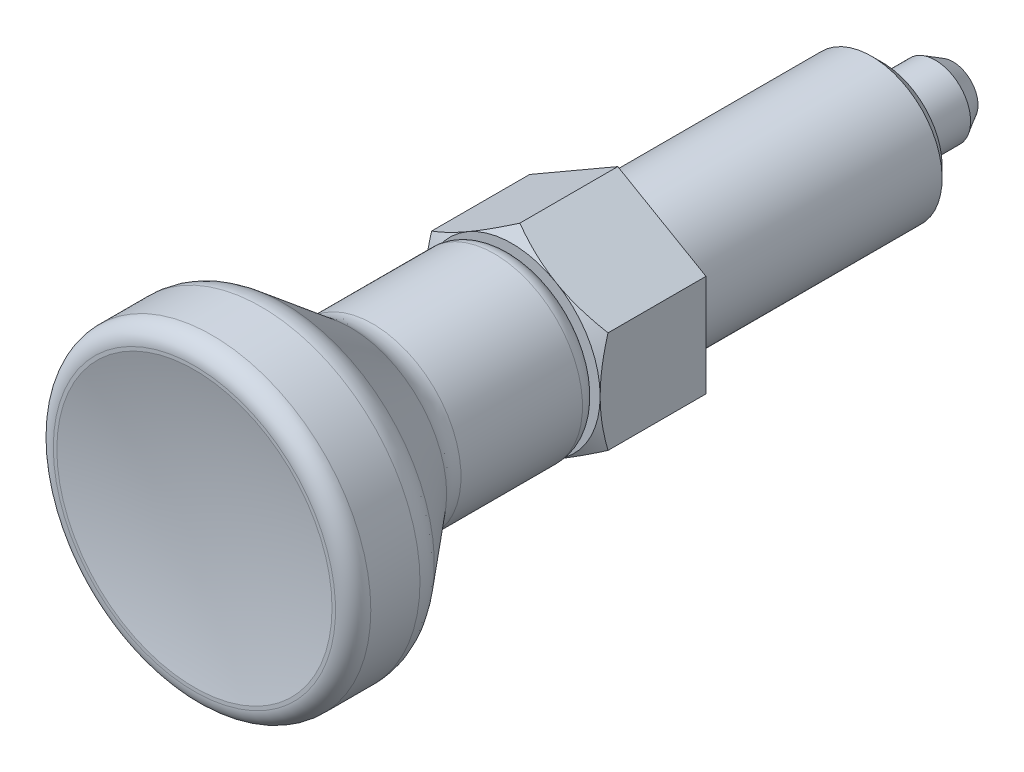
ISO-10303-21;
HEADER;
FILE_DESCRIPTION(('STEP AP214'),'2;1');
FILE_NAME('part.step','',(''),(''),'','','');
FILE_SCHEMA(('AUTOMOTIVE_DESIGN { 1 0 10303 214 1 1 1 1 }'));
ENDSEC;
DATA;
#1=APPLICATION_CONTEXT('core data for automotive mechanical design processes');
#2=APPLICATION_PROTOCOL_DEFINITION('international standard','automotive_design',2000,#1);
#3=PRODUCT_CONTEXT('',#1,'mechanical');
#4=PRODUCT('Part','Part','',(#3));
#5=PRODUCT_RELATED_PRODUCT_CATEGORY('part','',(#4));
#6=PRODUCT_DEFINITION_FORMATION('','',#4);
#7=PRODUCT_DEFINITION_CONTEXT('part definition',#1,'design');
#8=PRODUCT_DEFINITION('design','',#6,#7);
#9=PRODUCT_DEFINITION_SHAPE('','',#8);
#10=(LENGTH_UNIT() NAMED_UNIT(*) SI_UNIT(.MILLI.,.METRE.));
#11=(NAMED_UNIT(*) PLANE_ANGLE_UNIT() SI_UNIT($,.RADIAN.));
#12=(NAMED_UNIT(*) SI_UNIT($,.STERADIAN.) SOLID_ANGLE_UNIT());
#13=UNCERTAINTY_MEASURE_WITH_UNIT(LENGTH_MEASURE(1.E-05),#10,'distance_accuracy_value','');
#14=(GEOMETRIC_REPRESENTATION_CONTEXT(3) GLOBAL_UNCERTAINTY_ASSIGNED_CONTEXT((#13)) GLOBAL_UNIT_ASSIGNED_CONTEXT((#10,
#11,#12)) REPRESENTATION_CONTEXT('',''));
#15=CARTESIAN_POINT('',(0.,0.,0.));
#16=DIRECTION('',(0.,0.,1.));
#17=DIRECTION('',(1.,0.,0.));
#18=AXIS2_PLACEMENT_3D('',#15,#16,#17);
#19=CARTESIAN_POINT('',(0.,0.,3.1132486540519));
#20=DIRECTION('',(0.,0.,-1.));
#21=DIRECTION('',(0.,1.,0.));
#22=AXIS2_PLACEMENT_3D('',#19,#20,#21);
#23=CONICAL_SURFACE('',#22,10.,1.0471975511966);
#24=CARTESIAN_POINT('',(-5.,7.79521366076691,3.53993434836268));
#25=CARTESIAN_POINT('',(-5.,7.57645280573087,3.64621736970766));
#26=CARTESIAN_POINT('',(-5.,7.35719409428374,3.75149299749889));
#27=CARTESIAN_POINT('',(-5.,6.9174162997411,3.95946359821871));
#28=CARTESIAN_POINT('',(-5.,6.69689702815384,4.06215817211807));
#29=CARTESIAN_POINT('',(-5.,6.25321722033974,4.26490852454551));
#30=CARTESIAN_POINT('',(-5.,6.03004886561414,4.36494725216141));
#31=CARTESIAN_POINT('',(-5.,5.58195110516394,4.56098433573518));
#32=CARTESIAN_POINT('',(-5.,5.35702178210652,4.65698288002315));
#33=CARTESIAN_POINT('',(-5.,4.89769068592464,4.84691481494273));
#34=CARTESIAN_POINT('',(-5.,4.66321876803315,4.9406794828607));
#35=CARTESIAN_POINT('',(-5.,4.19154711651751,5.12121121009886));
#36=CARTESIAN_POINT('',(-5.,3.95434708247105,5.2079774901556));
#37=CARTESIAN_POINT('',(-5.,3.4772724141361,5.37226520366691));
#38=CARTESIAN_POINT('',(-5.,3.23740416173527,5.44980498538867));
#39=CARTESIAN_POINT('',(-5.,2.75422725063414,5.59317898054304));
#40=CARTESIAN_POINT('',(-5.,2.51091968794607,5.65901683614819));
#41=CARTESIAN_POINT('',(-5.,2.02205222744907,5.775510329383));
#42=CARTESIAN_POINT('',(-5.,1.77651220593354,5.82624785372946));
#43=CARTESIAN_POINT('',(-5.,1.28233650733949,5.90969033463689));
#44=CARTESIAN_POINT('',(-5.,1.03370114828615,5.94239712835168));
#45=CARTESIAN_POINT('',(-5.,0.537842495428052,5.98674256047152));
#46=CARTESIAN_POINT('',(-5.,0.290644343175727,5.99865539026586));
#47=CARTESIAN_POINT('',(-5.,-0.203882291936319,6.00112730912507));
#48=CARTESIAN_POINT('',(-5.,-0.451210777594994,5.99168591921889));
#49=CARTESIAN_POINT('',(-5.,-0.869833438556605,5.95830505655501));
#50=CARTESIAN_POINT('',(-5.,-1.04157084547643,5.93959455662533));
#51=CARTESIAN_POINT('',(-5.,-1.38380826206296,5.89301976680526));
#52=CARTESIAN_POINT('',(-5.,-1.55430810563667,5.86515427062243));
#53=CARTESIAN_POINT('',(-5.,-2.06370854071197,5.76928789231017));
#54=CARTESIAN_POINT('',(-5.,-2.40032984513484,5.68903341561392));
#55=CARTESIAN_POINT('',(-5.,-2.90383846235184,5.54959195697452));
#56=CARTESIAN_POINT('',(-5.,-3.07332661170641,5.49925959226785));
#57=CARTESIAN_POINT('',(-5.,-3.41065642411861,5.39330236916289));
#58=CARTESIAN_POINT('',(-5.,-3.57849807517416,5.33767747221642));
#59=CARTESIAN_POINT('',(-5.,-3.91258846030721,5.22203339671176));
#60=CARTESIAN_POINT('',(-5.,-4.07883767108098,5.16201558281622));
#61=CARTESIAN_POINT('',(-5.,-4.40995264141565,5.03829841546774));
#62=CARTESIAN_POINT('',(-5.,-4.57481842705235,4.97459913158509));
#63=CARTESIAN_POINT('',(-5.,-5.00125658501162,4.80523740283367));
#64=CARTESIAN_POINT('',(-5.,-5.26188398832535,4.69719842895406));
#65=CARTESIAN_POINT('',(-5.,-5.7806153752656,4.47520370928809));
#66=CARTESIAN_POINT('',(-5.,-6.0387191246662,4.3612474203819));
#67=CARTESIAN_POINT('',(-5.,-6.55294218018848,4.12875854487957));
#68=CARTESIAN_POINT('',(-5.,-6.80906088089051,4.01022462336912));
#69=CARTESIAN_POINT('',(-5.,-7.31963206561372,3.7696140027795));
#70=CARTESIAN_POINT('',(-5.,-7.57408450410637,3.64753720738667));
#71=CARTESIAN_POINT('',(-5.,-8.08197779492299,3.40041520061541));
#72=CARTESIAN_POINT('',(-5.,-8.33541675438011,3.27536610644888));
#73=CARTESIAN_POINT('',(-5.,-8.84117201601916,3.02301564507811));
#74=CARTESIAN_POINT('',(-5.,-9.09348830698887,2.89571425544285));
#75=CARTESIAN_POINT('',(-5.,-9.84895753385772,2.51114226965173));
#76=CARTESIAN_POINT('',(-5.,-10.3507276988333,2.25115628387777));
#77=CARTESIAN_POINT('',(-5.,-11.3022827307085,1.75218100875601));
#78=CARTESIAN_POINT('',(-5.,-11.7523102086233,1.51365220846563));
#79=CARTESIAN_POINT('',(-5.,-12.6508152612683,1.03363917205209));
#80=CARTESIAN_POINT('',(-5.,-13.0992927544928,0.792154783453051));
#81=CARTESIAN_POINT('',(-5.,-13.993693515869,0.307716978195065));
#82=CARTESIAN_POINT('',(-5.,-14.4396204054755,0.0647702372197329));
#83=CARTESIAN_POINT('',(-5.,-15.3305024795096,-0.422825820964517));
#84=CARTESIAN_POINT('',(-5.,-15.7754577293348,-0.667475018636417));
#85=CARTESIAN_POINT('',(-5.,-16.2200666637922,-0.91274800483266));
#86=B_SPLINE_CURVE_WITH_KNOTS('',3,(#24,#25,#26,#27,#28,#29,#30,#31,#32,#33,#34,#35,#36,#37,#38,
#39,#40,#41,#42,#43,#44,#45,#46,#47,#48,#49,#50,#51,#52,#53,#54,#55,#56,#57,#58,#59,#60,#61,#62,
#63,#64,#65,#66,#67,#68,#69,#70,#71,#72,#73,#74,#75,#76,#77,#78,#79,#80,#81,#82,#83,#84,#85),
.UNSPECIFIED.,.F.,.F.,(4,2,2,2,2,2,2,2,2,2,2,2,2,2,2,2,2,2,2,2,2,2,2,2,2,2,2,2,2,2,4),(0.,
0.729646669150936,1.45940545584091,2.19306727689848,2.9266948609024,3.68418360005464,
4.44175656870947,5.19779687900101,5.95360146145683,6.70522945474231,7.45678085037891,
8.19834515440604,8.93992609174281,9.45793663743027,9.97601546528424,11.0127134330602,
11.5430787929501,12.0734480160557,12.6036531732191,13.1338483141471,13.9801413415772,
14.8265121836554,15.6731317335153,16.5197743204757,17.3675913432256,18.2154168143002,
19.9107440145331,21.4387334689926,22.9668020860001,24.4902367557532,26.0135655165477),.UNSPECIFIED.);
#87=CARTESIAN_POINT('',(-5.,-2.8867513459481,5.55341801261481));
#88=VERTEX_POINT('',#87);
#89=CARTESIAN_POINT('',(-5.,0.,6.));
#90=VERTEX_POINT('',#89);
#91=EDGE_CURVE('E9',#88,#90,#86,.F.);
#92=ORIENTED_EDGE('',*,*,#91,.F.);
#93=CARTESIAN_POINT('',(0.0002,-5.77361816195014,5.55335134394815));
#94=CARTESIAN_POINT('',(-0.219534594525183,-5.64675433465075,5.62661343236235));
#95=CARTESIAN_POINT('',(-0.441148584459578,-5.51880543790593,5.69324867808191));
#96=CARTESIAN_POINT('',(-0.88821399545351,-5.26069210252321,5.80956100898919));
#97=CARTESIAN_POINT('',(-1.11367335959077,-5.13052307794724,5.85919695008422));
#98=CARTESIAN_POINT('',(-1.56183230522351,-4.87177839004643,5.93644897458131));
#99=CARTESIAN_POINT('',(-1.78446209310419,-4.74324302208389,5.96457962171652));
#100=CARTESIAN_POINT('',(-2.11918990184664,-4.54998783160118,5.98980507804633));
#101=CARTESIAN_POINT('',(-2.23084219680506,-4.48552534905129,5.99538654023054));
#102=CARTESIAN_POINT('',(-2.4542499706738,-4.35654081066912,6.00079778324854));
#103=CARTESIAN_POINT('',(-2.56600544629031,-4.29201875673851,6.0006277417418));
#104=CARTESIAN_POINT('',(-2.87218423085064,-4.11524635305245,5.99224636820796));
#105=CARTESIAN_POINT('',(-3.06650608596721,-4.00305457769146,5.97817022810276));
#106=CARTESIAN_POINT('',(-3.45386010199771,-3.77941563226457,5.9335347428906));
#107=CARTESIAN_POINT('',(-3.64689090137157,-3.66796924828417,5.90296013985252));
#108=CARTESIAN_POINT('',(-4.03502534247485,-3.44387972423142,5.82653150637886));
#109=CARTESIAN_POINT('',(-4.23007999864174,-3.33126486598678,5.78035362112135));
#110=CARTESIAN_POINT('',(-4.61728034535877,-3.10771464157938,5.67554820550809));
#111=CARTESIAN_POINT('',(-4.80943099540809,-2.99677641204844,5.61694529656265));
#112=CARTESIAN_POINT('',(-5.0002,-2.88663587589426,5.55335134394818));
#113=B_SPLINE_CURVE_WITH_KNOTS('',3,(#93,#94,#95,#96,#97,#98,#99,#100,#101,#102,#103,#104,#105,
#106,#107,#108,#109,#110,#111,#112),.UNSPECIFIED.,.F.,.F.,(4,2,2,2,2,2,2,2,2,4),(0.,
0.792555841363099,1.58701660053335,2.36181537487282,2.74884076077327,3.13585419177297,
3.80962362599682,4.48401723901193,5.17336882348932,5.8613669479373),.UNSPECIFIED.);
#114=CARTESIAN_POINT('',(-2.50000000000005,-4.33012701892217,6.));
#115=VERTEX_POINT('',#114);
#116=EDGE_CURVE('E207',#115,#88,#113,.T.);
#117=ORIENTED_EDGE('',*,*,#116,.F.);
#118=CARTESIAN_POINT('',(0.,0.,6.));
#119=DIRECTION('',(0.,0.,1.));
#120=DIRECTION('',(0.,-1.,0.));
#121=AXIS2_PLACEMENT_3D('',#118,#119,#120);
#122=CIRCLE('',#121,5.);
#123=EDGE_CURVE('E265',#90,#115,#122,.T.);
#124=ORIENTED_EDGE('',*,*,#123,.F.);
#125=EDGE_LOOP('',(#92,#117,#124));
#126=FACE_BOUND('',#125,.T.);
#127=ADVANCED_FACE('F14',(#126),#23,.T.);
#128=CARTESIAN_POINT('',(-5.,2.8867513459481,5.55341801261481));
#129=VERTEX_POINT('',#128);
#130=EDGE_CURVE('E18',#90,#129,#86,.F.);
#131=ORIENTED_EDGE('',*,*,#130,.F.);
#132=CARTESIAN_POINT('',(-2.50000000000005,4.33012701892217,6.));
#133=VERTEX_POINT('',#132);
#134=EDGE_CURVE('E116',#133,#90,#122,.T.);
#135=ORIENTED_EDGE('',*,*,#134,.F.);
#136=CARTESIAN_POINT('',(-5.0002,2.88663587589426,5.55335134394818));
#137=CARTESIAN_POINT('',(-4.78046540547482,3.01349970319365,5.62661343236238));
#138=CARTESIAN_POINT('',(-4.55885141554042,3.14144859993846,5.69324867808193));
#139=CARTESIAN_POINT('',(-4.1117860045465,3.39956193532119,5.80956100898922));
#140=CARTESIAN_POINT('',(-3.88632664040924,3.52973095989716,5.85919695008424));
#141=CARTESIAN_POINT('',(-3.43816769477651,3.78847564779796,5.93644897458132));
#142=CARTESIAN_POINT('',(-3.21553790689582,3.9170110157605,5.96457962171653));
#143=CARTESIAN_POINT('',(-2.88081009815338,4.11026620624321,5.98980507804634));
#144=CARTESIAN_POINT('',(-2.76915780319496,4.1747286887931,5.99538654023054));
#145=CARTESIAN_POINT('',(-2.54575002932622,4.30371322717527,6.00079778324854));
#146=CARTESIAN_POINT('',(-2.43399455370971,4.36823528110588,6.00062774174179));
#147=CARTESIAN_POINT('',(-2.12781576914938,4.54500768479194,5.99224636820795));
#148=CARTESIAN_POINT('',(-1.9334939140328,4.65719946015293,5.97817022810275));
#149=CARTESIAN_POINT('',(-1.5461398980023,4.88083840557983,5.93353474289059));
#150=CARTESIAN_POINT('',(-1.35310909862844,4.99228478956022,5.9029601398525));
#151=CARTESIAN_POINT('',(-0.96497465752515,5.21637431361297,5.82653150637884));
#152=CARTESIAN_POINT('',(-0.769920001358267,5.32898917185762,5.78035362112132));
#153=CARTESIAN_POINT('',(-0.382719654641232,5.55253939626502,5.67554820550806));
#154=CARTESIAN_POINT('',(-0.190569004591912,5.66347762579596,5.61694529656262));
#155=CARTESIAN_POINT('',(0.000200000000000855,5.77361816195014,5.55335134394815));
#156=B_SPLINE_CURVE_WITH_KNOTS('',3,(#136,#137,#138,#139,#140,#141,#142,#143,#144,#145,#146,
#147,#148,#149,#150,#151,#152,#153,#154,#155),.UNSPECIFIED.,.F.,.F.,(4,2,2,2,2,2,2,2,2,4),(0.,
0.792555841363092,1.58701660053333,2.3618153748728,2.74884076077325,3.13585419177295,
3.8096236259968,4.48401723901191,5.17336882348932,5.8613669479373),.UNSPECIFIED.);
#157=EDGE_CURVE('E268',#129,#133,#156,.T.);
#158=ORIENTED_EDGE('',*,*,#157,.F.);
#159=EDGE_LOOP('',(#131,#135,#158));
#160=FACE_BOUND('',#159,.T.);
#161=ADVANCED_FACE('F229',(#160),#23,.T.);
#162=CARTESIAN_POINT('',(0.,5.7735026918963,5.55341801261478));
#163=VERTEX_POINT('',#162);
#164=EDGE_CURVE('E112',#133,#163,#156,.T.);
#165=ORIENTED_EDGE('',*,*,#164,.F.);
#166=CARTESIAN_POINT('',(2.50000000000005,4.33012701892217,6.));
#167=VERTEX_POINT('',#166);
#168=EDGE_CURVE('E110',#167,#133,#122,.T.);
#169=ORIENTED_EDGE('',*,*,#168,.F.);
#170=CARTESIAN_POINT('',(-0.0002,5.77361816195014,5.55335134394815));
#171=CARTESIAN_POINT('',(0.219534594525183,5.64675433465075,5.62661343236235));
#172=CARTESIAN_POINT('',(0.441148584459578,5.51880543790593,5.69324867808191));
#173=CARTESIAN_POINT('',(0.88821399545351,5.26069210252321,5.80956100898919));
#174=CARTESIAN_POINT('',(1.11367335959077,5.13052307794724,5.85919695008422));
#175=CARTESIAN_POINT('',(1.56183230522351,4.87177839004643,5.93644897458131));
#176=CARTESIAN_POINT('',(1.78446209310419,4.74324302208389,5.96457962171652));
#177=CARTESIAN_POINT('',(2.11918990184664,4.54998783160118,5.98980507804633));
#178=CARTESIAN_POINT('',(2.23084219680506,4.48552534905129,5.99538654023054));
#179=CARTESIAN_POINT('',(2.4542499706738,4.35654081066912,6.00079778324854));
#180=CARTESIAN_POINT('',(2.56600544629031,4.29201875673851,6.0006277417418));
#181=CARTESIAN_POINT('',(2.87218423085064,4.11524635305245,5.99224636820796));
#182=CARTESIAN_POINT('',(3.06650608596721,4.00305457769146,5.97817022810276));
#183=CARTESIAN_POINT('',(3.45386010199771,3.77941563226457,5.9335347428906));
#184=CARTESIAN_POINT('',(3.64689090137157,3.66796924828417,5.90296013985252));
#185=CARTESIAN_POINT('',(4.03502534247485,3.44387972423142,5.82653150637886));
#186=CARTESIAN_POINT('',(4.23007999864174,3.33126486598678,5.78035362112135));
#187=CARTESIAN_POINT('',(4.61728034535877,3.10771464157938,5.67554820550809));
#188=CARTESIAN_POINT('',(4.80943099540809,2.99677641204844,5.61694529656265));
#189=CARTESIAN_POINT('',(5.0002,2.88663587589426,5.55335134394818));
#190=B_SPLINE_CURVE_WITH_KNOTS('',3,(#170,#171,#172,#173,#174,#175,#176,#177,#178,#179,#180,
#181,#182,#183,#184,#185,#186,#187,#188,#189),.UNSPECIFIED.,.F.,.F.,(4,2,2,2,2,2,2,2,2,4),(0.,
0.792555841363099,1.58701660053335,2.36181537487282,2.74884076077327,3.13585419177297,
3.80962362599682,4.48401723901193,5.17336882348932,5.8613669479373),.UNSPECIFIED.);
#191=EDGE_CURVE('E90',#163,#167,#190,.T.);
#192=ORIENTED_EDGE('',*,*,#191,.F.);
#193=EDGE_LOOP('',(#165,#169,#192));
#194=FACE_BOUND('',#193,.T.);
#195=ADVANCED_FACE('F111',(#194),#23,.T.);
#196=CARTESIAN_POINT('',(0.,-5.7735026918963,5.55341801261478));
#197=VERTEX_POINT('',#196);
#198=EDGE_CURVE('E202',#197,#115,#113,.T.);
#199=ORIENTED_EDGE('',*,*,#198,.F.);
#200=CARTESIAN_POINT('',(5.0002,-2.88663587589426,5.55335134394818));
#201=CARTESIAN_POINT('',(4.78046540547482,-3.01349970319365,5.62661343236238));
#202=CARTESIAN_POINT('',(4.55885141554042,-3.14144859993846,5.69324867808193));
#203=CARTESIAN_POINT('',(4.1117860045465,-3.39956193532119,5.80956100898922));
#204=CARTESIAN_POINT('',(3.88632664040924,-3.52973095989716,5.85919695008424));
#205=CARTESIAN_POINT('',(3.43816769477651,-3.78847564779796,5.93644897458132));
#206=CARTESIAN_POINT('',(3.21553790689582,-3.9170110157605,5.96457962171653));
#207=CARTESIAN_POINT('',(2.88081009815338,-4.11026620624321,5.98980507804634));
#208=CARTESIAN_POINT('',(2.76915780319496,-4.1747286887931,5.99538654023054));
#209=CARTESIAN_POINT('',(2.54575002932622,-4.30371322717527,6.00079778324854));
#210=CARTESIAN_POINT('',(2.43399455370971,-4.36823528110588,6.00062774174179));
#211=CARTESIAN_POINT('',(2.12781576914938,-4.54500768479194,5.99224636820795));
#212=CARTESIAN_POINT('',(1.9334939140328,-4.65719946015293,5.97817022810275));
#213=CARTESIAN_POINT('',(1.5461398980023,-4.88083840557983,5.93353474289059));
#214=CARTESIAN_POINT('',(1.35310909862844,-4.99228478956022,5.9029601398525));
#215=CARTESIAN_POINT('',(0.96497465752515,-5.21637431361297,5.82653150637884));
#216=CARTESIAN_POINT('',(0.769920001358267,-5.32898917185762,5.78035362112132));
#217=CARTESIAN_POINT('',(0.382719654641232,-5.55253939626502,5.67554820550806));
#218=CARTESIAN_POINT('',(0.190569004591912,-5.66347762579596,5.61694529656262));
#219=CARTESIAN_POINT('',(-0.000200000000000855,-5.77361816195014,5.55335134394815));
#220=B_SPLINE_CURVE_WITH_KNOTS('',3,(#200,#201,#202,#203,#204,#205,#206,#207,#208,#209,#210,
#211,#212,#213,#214,#215,#216,#217,#218,#219),.UNSPECIFIED.,.F.,.F.,(4,2,2,2,2,2,2,2,2,4),(0.,
0.792555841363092,1.58701660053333,2.3618153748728,2.74884076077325,3.13585419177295,
3.8096236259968,4.48401723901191,5.17336882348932,5.8613669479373),.UNSPECIFIED.);
#221=CARTESIAN_POINT('',(2.50000000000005,-4.33012701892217,6.));
#222=VERTEX_POINT('',#221);
#223=EDGE_CURVE('E100',#222,#197,#220,.T.);
#224=ORIENTED_EDGE('',*,*,#223,.F.);
#225=EDGE_CURVE('E123',#115,#222,#122,.T.);
#226=ORIENTED_EDGE('',*,*,#225,.F.);
#227=EDGE_LOOP('',(#199,#224,#226));
#228=FACE_BOUND('',#227,.T.);
#229=ADVANCED_FACE('F247',(#228),#23,.T.);
#230=CARTESIAN_POINT('',(5.,2.8867513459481,5.55341801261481));
#231=VERTEX_POINT('',#230);
#232=EDGE_CURVE('E94',#167,#231,#190,.T.);
#233=ORIENTED_EDGE('',*,*,#232,.F.);
#234=CARTESIAN_POINT('',(5.,0.,6.));
#235=VERTEX_POINT('',#234);
#236=EDGE_CURVE('E106',#235,#167,#122,.T.);
#237=ORIENTED_EDGE('',*,*,#236,.F.);
#238=CARTESIAN_POINT('',(5.,7.79521366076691,3.53993434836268));
#239=CARTESIAN_POINT('',(5.,7.57645280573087,3.64621736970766));
#240=CARTESIAN_POINT('',(5.,7.35719409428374,3.75149299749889));
#241=CARTESIAN_POINT('',(5.,6.9174162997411,3.95946359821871));
#242=CARTESIAN_POINT('',(5.,6.69689702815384,4.06215817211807));
#243=CARTESIAN_POINT('',(5.,6.25321722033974,4.26490852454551));
#244=CARTESIAN_POINT('',(5.,6.03004886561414,4.36494725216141));
#245=CARTESIAN_POINT('',(5.,5.58195110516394,4.56098433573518));
#246=CARTESIAN_POINT('',(5.,5.35702178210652,4.65698288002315));
#247=CARTESIAN_POINT('',(5.,4.89769068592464,4.84691481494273));
#248=CARTESIAN_POINT('',(5.,4.66321876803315,4.9406794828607));
#249=CARTESIAN_POINT('',(5.,4.19154711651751,5.12121121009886));
#250=CARTESIAN_POINT('',(5.,3.95434708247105,5.2079774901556));
#251=CARTESIAN_POINT('',(5.,3.4772724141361,5.37226520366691));
#252=CARTESIAN_POINT('',(5.,3.23740416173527,5.44980498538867));
#253=CARTESIAN_POINT('',(5.,2.75422725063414,5.59317898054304));
#254=CARTESIAN_POINT('',(5.,2.51091968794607,5.65901683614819));
#255=CARTESIAN_POINT('',(5.,2.02205222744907,5.775510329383));
#256=CARTESIAN_POINT('',(5.,1.77651220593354,5.82624785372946));
#257=CARTESIAN_POINT('',(5.,1.28233650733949,5.90969033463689));
#258=CARTESIAN_POINT('',(5.,1.03370114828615,5.94239712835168));
#259=CARTESIAN_POINT('',(5.,0.537842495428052,5.98674256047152));
#260=CARTESIAN_POINT('',(5.,0.290644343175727,5.99865539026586));
#261=CARTESIAN_POINT('',(5.,-0.203882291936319,6.00112730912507));
#262=CARTESIAN_POINT('',(5.,-0.451210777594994,5.99168591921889));
#263=CARTESIAN_POINT('',(5.,-0.869833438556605,5.95830505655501));
#264=CARTESIAN_POINT('',(5.,-1.04157084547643,5.93959455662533));
#265=CARTESIAN_POINT('',(5.,-1.38380826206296,5.89301976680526));
#266=CARTESIAN_POINT('',(5.,-1.55430810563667,5.86515427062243));
#267=CARTESIAN_POINT('',(5.,-2.06370854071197,5.76928789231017));
#268=CARTESIAN_POINT('',(5.,-2.40032984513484,5.68903341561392));
#269=CARTESIAN_POINT('',(5.,-2.90383846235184,5.54959195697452));
#270=CARTESIAN_POINT('',(5.,-3.07332661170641,5.49925959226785));
#271=CARTESIAN_POINT('',(5.,-3.41065642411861,5.39330236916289));
#272=CARTESIAN_POINT('',(5.,-3.57849807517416,5.33767747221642));
#273=CARTESIAN_POINT('',(5.,-3.91258846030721,5.22203339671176));
#274=CARTESIAN_POINT('',(5.,-4.07883767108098,5.16201558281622));
#275=CARTESIAN_POINT('',(5.,-4.40995264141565,5.03829841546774));
#276=CARTESIAN_POINT('',(5.,-4.57481842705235,4.97459913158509));
#277=CARTESIAN_POINT('',(5.,-5.00125658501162,4.80523740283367));
#278=CARTESIAN_POINT('',(5.,-5.26188398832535,4.69719842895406));
#279=CARTESIAN_POINT('',(5.,-5.7806153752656,4.47520370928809));
#280=CARTESIAN_POINT('',(5.,-6.0387191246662,4.3612474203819));
#281=CARTESIAN_POINT('',(5.,-6.55294218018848,4.12875854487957));
#282=CARTESIAN_POINT('',(5.,-6.80906088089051,4.01022462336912));
#283=CARTESIAN_POINT('',(5.,-7.31963206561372,3.7696140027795));
#284=CARTESIAN_POINT('',(5.,-7.57408450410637,3.64753720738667));
#285=CARTESIAN_POINT('',(5.,-8.08197779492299,3.40041520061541));
#286=CARTESIAN_POINT('',(5.,-8.33541675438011,3.27536610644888));
#287=CARTESIAN_POINT('',(5.,-8.84117201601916,3.02301564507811));
#288=CARTESIAN_POINT('',(5.,-9.09348830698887,2.89571425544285));
#289=CARTESIAN_POINT('',(5.,-9.84895753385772,2.51114226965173));
#290=CARTESIAN_POINT('',(5.,-10.3507276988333,2.25115628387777));
#291=CARTESIAN_POINT('',(5.,-11.3022827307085,1.75218100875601));
#292=CARTESIAN_POINT('',(5.,-11.7523102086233,1.51365220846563));
#293=CARTESIAN_POINT('',(5.,-12.6508152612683,1.03363917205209));
#294=CARTESIAN_POINT('',(5.,-13.0992927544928,0.792154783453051));
#295=CARTESIAN_POINT('',(5.,-13.993693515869,0.307716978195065));
#296=CARTESIAN_POINT('',(5.,-14.4396204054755,0.0647702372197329));
#297=CARTESIAN_POINT('',(5.,-15.3305024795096,-0.422825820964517));
#298=CARTESIAN_POINT('',(5.,-15.7754577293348,-0.667475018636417));
#299=CARTESIAN_POINT('',(5.,-16.2200666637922,-0.91274800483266));
#300=B_SPLINE_CURVE_WITH_KNOTS('',3,(#238,#239,#240,#241,#242,#243,#244,#245,#246,#247,#248,
#249,#250,#251,#252,#253,#254,#255,#256,#257,#258,#259,#260,#261,#262,#263,#264,#265,#266,#267,
#268,#269,#270,#271,#272,#273,#274,#275,#276,#277,#278,#279,#280,#281,#282,#283,#284,#285,#286,
#287,#288,#289,#290,#291,#292,#293,#294,#295,#296,#297,#298,#299),.UNSPECIFIED.,.F.,.F.,(4,2,2,
2,2,2,2,2,2,2,2,2,2,2,2,2,2,2,2,2,2,2,2,2,2,2,2,2,2,2,4),(0.,0.729646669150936,1.45940545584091,
2.19306727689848,2.9266948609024,3.68418360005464,4.44175656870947,5.19779687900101,
5.95360146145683,6.70522945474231,7.45678085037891,8.19834515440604,8.93992609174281,
9.45793663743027,9.97601546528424,11.0127134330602,11.5430787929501,12.0734480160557,
12.6036531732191,13.1338483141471,13.9801413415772,14.8265121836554,15.6731317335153,
16.5197743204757,17.3675913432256,18.2154168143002,19.9107440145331,21.4387334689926,
22.9668020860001,24.4902367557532,26.0135655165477),.UNSPECIFIED.);
#301=EDGE_CURVE('E41',#231,#235,#300,.T.);
#302=ORIENTED_EDGE('',*,*,#301,.F.);
#303=EDGE_LOOP('',(#233,#237,#302));
#304=FACE_BOUND('',#303,.T.);
#305=ADVANCED_FACE('F104',(#304),#23,.T.);
#306=CARTESIAN_POINT('',(5.,-2.8867513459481,5.55341801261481));
#307=VERTEX_POINT('',#306);
#308=EDGE_CURVE('E108',#307,#222,#220,.T.);
#309=ORIENTED_EDGE('',*,*,#308,.F.);
#310=EDGE_CURVE('E172',#235,#307,#300,.T.);
#311=ORIENTED_EDGE('',*,*,#310,.F.);
#312=EDGE_CURVE('E121',#222,#235,#122,.T.);
#313=ORIENTED_EDGE('',*,*,#312,.F.);
#314=EDGE_LOOP('',(#309,#311,#313));
#315=FACE_BOUND('',#314,.T.);
#316=ADVANCED_FACE('F231',(#315),#23,.T.);
#317=CARTESIAN_POINT('',(-4.93181884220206E-12,0.,59.1448431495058));
#318=DIRECTION('',(0.,0.,1.));
#319=DIRECTION('',(1.,0.,0.));
#320=AXIS2_PLACEMENT_3D('',#317,#318,#319);
#321=SPHERICAL_SURFACE('',#320,36.0000000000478);
#322=CARTESIAN_POINT('',(0.,0.,24.));
#323=DIRECTION('',(0.,0.,1.));
#324=DIRECTION('',(-1.,0.,0.));
#325=AXIS2_PLACEMENT_3D('',#322,#323,#324);
#326=CIRCLE('',#325,7.8);
#327=CARTESIAN_POINT('',(-7.8,0.,24.));
#328=VERTEX_POINT('',#327);
#329=EDGE_CURVE('E169',#328,#328,#326,.T.);
#330=ORIENTED_EDGE('',*,*,#329,.T.);
#331=EDGE_LOOP('',(#330));
#332=FACE_BOUND('',#331,.T.);
#333=ADVANCED_FACE('F16',(#332),#321,.F.);
#334=CARTESIAN_POINT('',(7.8,0.,24.));
#335=DIRECTION('',(0.,0.,1.));
#336=DIRECTION('',(-1.,0.,0.));
#337=AXIS2_PLACEMENT_3D('',#334,#335,#336);
#338=PLANE('',#337);
#339=CARTESIAN_POINT('',(0.,0.,24.));
#340=DIRECTION('',(0.,0.,1.));
#341=DIRECTION('',(-1.,0.,0.));
#342=AXIS2_PLACEMENT_3D('',#339,#340,#341);
#343=CIRCLE('',#342,8.);
#344=CARTESIAN_POINT('',(-8.00000000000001,0.,24.));
#345=VERTEX_POINT('',#344);
#346=EDGE_CURVE('E166',#345,#345,#343,.T.);
#347=ORIENTED_EDGE('',*,*,#346,.T.);
#348=EDGE_LOOP('',(#347));
#349=FACE_BOUND('',#348,.T.);
#350=ORIENTED_EDGE('',*,*,#329,.F.);
#351=EDGE_LOOP('',(#350));
#352=FACE_BOUND('',#351,.T.);
#353=ADVANCED_FACE('F245',(#349,#352),#338,.T.);
#354=CARTESIAN_POINT('',(0.,0.,23.0000000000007));
#355=DIRECTION('',(0.,0.,1.));
#356=DIRECTION('',(-1.,0.,0.));
#357=AXIS2_PLACEMENT_3D('',#354,#355,#356);
#358=TOROIDAL_SURFACE('',#357,8.00000000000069,0.999999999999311);
#359=CARTESIAN_POINT('',(0.,0.,23.));
#360=DIRECTION('',(0.,0.,1.));
#361=DIRECTION('',(-1.,0.,0.));
#362=AXIS2_PLACEMENT_3D('',#359,#360,#361);
#363=CIRCLE('',#362,9.);
#364=CARTESIAN_POINT('',(-9.00000000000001,0.,23.));
#365=VERTEX_POINT('',#364);
#366=EDGE_CURVE('E163',#365,#365,#363,.T.);
#367=ORIENTED_EDGE('',*,*,#366,.T.);
#368=EDGE_LOOP('',(#367));
#369=FACE_BOUND('',#368,.T.);
#370=ORIENTED_EDGE('',*,*,#346,.F.);
#371=EDGE_LOOP('',(#370));
#372=FACE_BOUND('',#371,.T.);
#373=ADVANCED_FACE('F349',(#369,#372),#358,.T.);
#374=CARTESIAN_POINT('',(0.,0.,-19.));
#375=DIRECTION('',(0.,0.,1.));
#376=DIRECTION('',(-1.,0.,0.));
#377=AXIS2_PLACEMENT_3D('',#374,#375,#376);
#378=CYLINDRICAL_SURFACE('',#377,9.);
#379=CARTESIAN_POINT('',(0.,0.,20.212672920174));
#380=DIRECTION('',(0.,0.,1.));
#381=DIRECTION('',(-1.,0.,0.));
#382=AXIS2_PLACEMENT_3D('',#379,#380,#381);
#383=CIRCLE('',#382,9.);
#384=CARTESIAN_POINT('',(-9.00000000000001,0.,20.212672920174));
#385=VERTEX_POINT('',#384);
#386=EDGE_CURVE('E160',#385,#385,#383,.T.);
#387=ORIENTED_EDGE('',*,*,#386,.T.);
#388=EDGE_LOOP('',(#387));
#389=FACE_BOUND('',#388,.T.);
#390=ORIENTED_EDGE('',*,*,#366,.F.);
#391=EDGE_LOOP('',(#390));
#392=FACE_BOUND('',#391,.T.);
#393=ADVANCED_FACE('F345',(#389,#392),#378,.T.);
#394=CARTESIAN_POINT('',(0.,0.,20.2126729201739));
#395=DIRECTION('',(0.,0.,1.));
#396=DIRECTION('',(-1.,0.,0.));
#397=AXIS2_PLACEMENT_3D('',#394,#395,#396);
#398=TOROIDAL_SURFACE('',#397,6.99999999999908,2.00000000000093);
#399=CARTESIAN_POINT('',(0.,0.,18.947919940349));
#400=DIRECTION('',(0.,0.,1.));
#401=DIRECTION('',(-1.,0.,0.));
#402=AXIS2_PLACEMENT_3D('',#399,#400,#401);
#403=CIRCLE('',#402,8.54932240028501);
#404=CARTESIAN_POINT('',(-8.54932240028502,0.,18.947919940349));
#405=VERTEX_POINT('',#404);
#406=EDGE_CURVE('E157',#405,#405,#403,.T.);
#407=ORIENTED_EDGE('',*,*,#406,.T.);
#408=EDGE_LOOP('',(#407));
#409=FACE_BOUND('',#408,.T.);
#410=ORIENTED_EDGE('',*,*,#386,.F.);
#411=EDGE_LOOP('',(#410));
#412=FACE_BOUND('',#411,.T.);
#413=ADVANCED_FACE('F341',(#409,#412),#398,.T.);
#414=CARTESIAN_POINT('',(0.,0.,18.947919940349));
#415=DIRECTION('',(0.,0.,1.));
#416=DIRECTION('',(-1.,0.,0.));
#417=AXIS2_PLACEMENT_3D('',#414,#415,#416);
#418=CONICAL_SURFACE('',#417,8.54932240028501,0.684617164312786);
#419=CARTESIAN_POINT('',(0.,0.,15.1520800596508));
#420=DIRECTION('',(0.,0.,1.));
#421=DIRECTION('',(-1.,0.,0.));
#422=AXIS2_PLACEMENT_3D('',#419,#420,#421);
#423=CIRCLE('',#422,5.450677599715);
#424=CARTESIAN_POINT('',(-5.45067759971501,0.,15.1520800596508));
#425=VERTEX_POINT('',#424);
#426=EDGE_CURVE('E154',#425,#425,#423,.T.);
#427=ORIENTED_EDGE('',*,*,#426,.T.);
#428=EDGE_LOOP('',(#427));
#429=FACE_BOUND('',#428,.T.);
#430=ORIENTED_EDGE('',*,*,#406,.F.);
#431=EDGE_LOOP('',(#430));
#432=FACE_BOUND('',#431,.T.);
#433=ADVANCED_FACE('F337',(#429,#432),#418,.T.);
#434=CARTESIAN_POINT('',(0.,0.,13.8873270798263));
#435=DIRECTION('',(0.,0.,1.));
#436=DIRECTION('',(-1.,0.,0.));
#437=AXIS2_PLACEMENT_3D('',#434,#435,#436);
#438=TOROIDAL_SURFACE('',#437,6.99999999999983,1.99999999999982);
#439=CARTESIAN_POINT('',(0.,0.,13.8873270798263));
#440=DIRECTION('',(0.,0.,1.));
#441=DIRECTION('',(-1.,0.,0.));
#442=AXIS2_PLACEMENT_3D('',#439,#440,#441);
#443=CIRCLE('',#442,5.);
#444=CARTESIAN_POINT('',(-5.00000000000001,0.,13.8873270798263));
#445=VERTEX_POINT('',#444);
#446=EDGE_CURVE('E151',#445,#445,#443,.T.);
#447=ORIENTED_EDGE('',*,*,#446,.T.);
#448=EDGE_LOOP('',(#447));
#449=FACE_BOUND('',#448,.T.);
#450=ORIENTED_EDGE('',*,*,#426,.F.);
#451=EDGE_LOOP('',(#450));
#452=FACE_BOUND('',#451,.T.);
#453=ADVANCED_FACE('F333',(#449,#452),#438,.F.);
#454=CARTESIAN_POINT('',(0.,0.,-19.));
#455=DIRECTION('',(0.,0.,1.));
#456=DIRECTION('',(-1.,0.,0.));
#457=AXIS2_PLACEMENT_3D('',#454,#455,#456);
#458=CYLINDRICAL_SURFACE('',#457,5.);
#459=CARTESIAN_POINT('',(0.,0.,7.));
#460=DIRECTION('',(0.,0.,1.));
#461=DIRECTION('',(-1.,0.,0.));
#462=AXIS2_PLACEMENT_3D('',#459,#460,#461);
#463=CIRCLE('',#462,5.);
#464=CARTESIAN_POINT('',(-5.00000000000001,0.,7.));
#465=VERTEX_POINT('',#464);
#466=EDGE_CURVE('E148',#465,#465,#463,.T.);
#467=ORIENTED_EDGE('',*,*,#466,.T.);
#468=EDGE_LOOP('',(#467));
#469=FACE_BOUND('',#468,.T.);
#470=ORIENTED_EDGE('',*,*,#446,.F.);
#471=EDGE_LOOP('',(#470));
#472=FACE_BOUND('',#471,.T.);
#473=ADVANCED_FACE('F329',(#469,#472),#458,.T.);
#474=CARTESIAN_POINT('',(0.,0.,7.00000000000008));
#475=DIRECTION('',(0.,0.,1.));
#476=DIRECTION('',(-1.,0.,0.));
#477=AXIS2_PLACEMENT_3D('',#474,#475,#476);
#478=TOROIDAL_SURFACE('',#477,3.99999999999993,1.00000000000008);
#479=CARTESIAN_POINT('',(0.,0.,6.));
#480=DIRECTION('',(0.,0.,1.));
#481=DIRECTION('',(-1.,0.,0.));
#482=AXIS2_PLACEMENT_3D('',#479,#480,#481);
#483=CIRCLE('',#482,4.);
#484=CARTESIAN_POINT('',(-4.00000000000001,0.,6.));
#485=VERTEX_POINT('',#484);
#486=EDGE_CURVE('E145',#485,#485,#483,.T.);
#487=ORIENTED_EDGE('',*,*,#486,.T.);
#488=EDGE_LOOP('',(#487));
#489=FACE_BOUND('',#488,.T.);
#490=ORIENTED_EDGE('',*,*,#466,.F.);
#491=EDGE_LOOP('',(#490));
#492=FACE_BOUND('',#491,.T.);
#493=ADVANCED_FACE('F318',(#489,#492),#478,.T.);
#494=CARTESIAN_POINT('',(5.,0.,6.));
#495=DIRECTION('',(0.,0.,-1.));
#496=DIRECTION('',(0.,1.,0.));
#497=AXIS2_PLACEMENT_3D('',#494,#495,#496);
#498=PLANE('',#497);
#499=ORIENTED_EDGE('',*,*,#486,.F.);
#500=EDGE_LOOP('',(#499));
#501=FACE_BOUND('',#500,.T.);
#502=ORIENTED_EDGE('',*,*,#312,.T.);
#503=ORIENTED_EDGE('',*,*,#236,.T.);
#504=ORIENTED_EDGE('',*,*,#168,.T.);
#505=ORIENTED_EDGE('',*,*,#134,.T.);
#506=ORIENTED_EDGE('',*,*,#123,.T.);
#507=ORIENTED_EDGE('',*,*,#225,.T.);
#508=EDGE_LOOP('',(#502,#503,#504,#505,#506,#507));
#509=FACE_BOUND('',#508,.T.);
#510=ADVANCED_FACE('F118',(#501,#509),#498,.F.);
#511=CARTESIAN_POINT('',(5.,2.8867513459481,-2.));
#512=DIRECTION('',(0.500000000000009,0.866025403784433,0.));
#513=DIRECTION('',(-0.866025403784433,0.500000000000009,0.));
#514=AXIS2_PLACEMENT_3D('',#511,#512,#513);
#515=PLANE('',#514);
#516=DIRECTION('',(-0.866025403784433,0.500000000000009,0.));
#517=VECTOR('',#516,1.);
#518=CARTESIAN_POINT('',(5.5,2.59807621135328,0.));
#519=LINE('',#518,#517);
#520=CARTESIAN_POINT('',(5.,2.8867513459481,0.));
#521=VERTEX_POINT('',#520);
#522=CARTESIAN_POINT('',(0.,5.7735026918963,0.));
#523=VERTEX_POINT('',#522);
#524=EDGE_CURVE('E126',#521,#523,#519,.T.);
#525=ORIENTED_EDGE('',*,*,#524,.T.);
#526=DIRECTION('',(0.,0.,1.));
#527=VECTOR('',#526,1.);
#528=CARTESIAN_POINT('',(0.,5.7735026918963,-2.));
#529=LINE('',#528,#527);
#530=EDGE_CURVE('E96',#523,#163,#529,.T.);
#531=ORIENTED_EDGE('',*,*,#530,.T.);
#532=ORIENTED_EDGE('',*,*,#191,.T.);
#533=ORIENTED_EDGE('',*,*,#232,.T.);
#534=DIRECTION('',(0.,0.,1.));
#535=VECTOR('',#534,1.);
#536=CARTESIAN_POINT('',(5.,2.8867513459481,-2.));
#537=LINE('',#536,#535);
#538=EDGE_CURVE('E288',#521,#231,#537,.T.);
#539=ORIENTED_EDGE('',*,*,#538,.F.);
#540=EDGE_LOOP('',(#525,#531,#532,#533,#539));
#541=FACE_BOUND('',#540,.T.);
#542=ADVANCED_FACE('F92',(#541),#515,.T.);
#543=CARTESIAN_POINT('',(0.,5.7735026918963,-2.));
#544=DIRECTION('',(-0.500000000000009,0.866025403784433,0.));
#545=DIRECTION('',(-0.866025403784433,-0.500000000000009,0.));
#546=AXIS2_PLACEMENT_3D('',#543,#544,#545);
#547=PLANE('',#546);
#548=DIRECTION('',(-0.866025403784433,-0.500000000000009,0.));
#549=VECTOR('',#548,1.);
#550=CARTESIAN_POINT('',(0.499999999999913,6.06217782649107,0.));
#551=LINE('',#550,#549);
#552=CARTESIAN_POINT('',(-5.,2.8867513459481,0.));
#553=VERTEX_POINT('',#552);
#554=EDGE_CURVE('E272',#523,#553,#551,.T.);
#555=ORIENTED_EDGE('',*,*,#554,.T.);
#556=DIRECTION('',(0.,0.,1.));
#557=VECTOR('',#556,1.);
#558=CARTESIAN_POINT('',(-5.,2.8867513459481,-2.));
#559=LINE('',#558,#557);
#560=EDGE_CURVE('E275',#553,#129,#559,.T.);
#561=ORIENTED_EDGE('',*,*,#560,.T.);
#562=ORIENTED_EDGE('',*,*,#157,.T.);
#563=ORIENTED_EDGE('',*,*,#164,.T.);
#564=ORIENTED_EDGE('',*,*,#530,.F.);
#565=EDGE_LOOP('',(#555,#561,#562,#563,#564));
#566=FACE_BOUND('',#565,.T.);
#567=ADVANCED_FACE('F196',(#566),#547,.T.);
#568=CARTESIAN_POINT('',(-5.,2.8867513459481,-2.));
#569=DIRECTION('',(-1.,0.,0.));
#570=DIRECTION('',(0.,-1.,0.));
#571=AXIS2_PLACEMENT_3D('',#568,#569,#570);
#572=PLANE('',#571);
#573=DIRECTION('',(0.,-1.,0.));
#574=VECTOR('',#573,1.);
#575=CARTESIAN_POINT('',(-5.,0.,0.));
#576=LINE('',#575,#574);
#577=CARTESIAN_POINT('',(-5.,-2.8867513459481,0.));
#578=VERTEX_POINT('',#577);
#579=EDGE_CURVE('E281',#553,#578,#576,.T.);
#580=ORIENTED_EDGE('',*,*,#579,.T.);
#581=DIRECTION('',(0.,0.,1.));
#582=VECTOR('',#581,1.);
#583=CARTESIAN_POINT('',(-5.,-2.8867513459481,-2.));
#584=LINE('',#583,#582);
#585=EDGE_CURVE('E262',#578,#88,#584,.T.);
#586=ORIENTED_EDGE('',*,*,#585,.T.);
#587=ORIENTED_EDGE('',*,*,#91,.T.);
#588=ORIENTED_EDGE('',*,*,#130,.T.);
#589=ORIENTED_EDGE('',*,*,#560,.F.);
#590=EDGE_LOOP('',(#580,#586,#587,#588,#589));
#591=FACE_BOUND('',#590,.T.);
#592=ADVANCED_FACE('F216',(#591),#572,.T.);
#593=CARTESIAN_POINT('',(-5.,-2.8867513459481,-2.));
#594=DIRECTION('',(-0.500000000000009,-0.866025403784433,0.));
#595=DIRECTION('',(0.866025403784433,-0.500000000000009,0.));
#596=AXIS2_PLACEMENT_3D('',#593,#594,#595);
#597=PLANE('',#596);
#598=DIRECTION('',(0.866025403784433,-0.500000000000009,0.));
#599=VECTOR('',#598,1.);
#600=CARTESIAN_POINT('',(0.499999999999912,-6.06217782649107,0.));
#601=LINE('',#600,#599);
#602=CARTESIAN_POINT('',(0.,-5.7735026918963,0.));
#603=VERTEX_POINT('',#602);
#604=EDGE_CURVE('E261',#578,#603,#601,.T.);
#605=ORIENTED_EDGE('',*,*,#604,.T.);
#606=DIRECTION('',(0.,0.,1.));
#607=VECTOR('',#606,1.);
#608=CARTESIAN_POINT('',(0.,-5.7735026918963,-2.));
#609=LINE('',#608,#607);
#610=EDGE_CURVE('E253',#603,#197,#609,.T.);
#611=ORIENTED_EDGE('',*,*,#610,.T.);
#612=ORIENTED_EDGE('',*,*,#198,.T.);
#613=ORIENTED_EDGE('',*,*,#116,.T.);
#614=ORIENTED_EDGE('',*,*,#585,.F.);
#615=EDGE_LOOP('',(#605,#611,#612,#613,#614));
#616=FACE_BOUND('',#615,.T.);
#617=ADVANCED_FACE('F213',(#616),#597,.T.);
#618=CARTESIAN_POINT('',(0.,-5.7735026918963,-2.));
#619=DIRECTION('',(0.500000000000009,-0.866025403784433,0.));
#620=DIRECTION('',(0.866025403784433,0.500000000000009,0.));
#621=AXIS2_PLACEMENT_3D('',#618,#619,#620);
#622=PLANE('',#621);
#623=DIRECTION('',(0.866025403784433,0.500000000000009,0.));
#624=VECTOR('',#623,1.);
#625=CARTESIAN_POINT('',(5.5,-2.59807621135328,0.));
#626=LINE('',#625,#624);
#627=CARTESIAN_POINT('',(5.,-2.8867513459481,0.));
#628=VERTEX_POINT('',#627);
#629=EDGE_CURVE('E285',#603,#628,#626,.T.);
#630=ORIENTED_EDGE('',*,*,#629,.T.);
#631=DIRECTION('',(0.,0.,1.));
#632=VECTOR('',#631,1.);
#633=CARTESIAN_POINT('',(5.,-2.8867513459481,-2.));
#634=LINE('',#633,#632);
#635=EDGE_CURVE('E35',#628,#307,#634,.T.);
#636=ORIENTED_EDGE('',*,*,#635,.T.);
#637=ORIENTED_EDGE('',*,*,#308,.T.);
#638=ORIENTED_EDGE('',*,*,#223,.T.);
#639=ORIENTED_EDGE('',*,*,#610,.F.);
#640=EDGE_LOOP('',(#630,#636,#637,#638,#639));
#641=FACE_BOUND('',#640,.T.);
#642=ADVANCED_FACE('F191',(#641),#622,.T.);
#643=CARTESIAN_POINT('',(5.,-2.8867513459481,-2.));
#644=DIRECTION('',(1.,0.,0.));
#645=DIRECTION('',(0.,1.,0.));
#646=AXIS2_PLACEMENT_3D('',#643,#644,#645);
#647=PLANE('',#646);
#648=DIRECTION('',(0.,1.,0.));
#649=VECTOR('',#648,1.);
#650=CARTESIAN_POINT('',(5.,0.,0.));
#651=LINE('',#650,#649);
#652=EDGE_CURVE('E274',#628,#521,#651,.T.);
#653=ORIENTED_EDGE('',*,*,#652,.T.);
#654=ORIENTED_EDGE('',*,*,#538,.T.);
#655=ORIENTED_EDGE('',*,*,#301,.T.);
#656=ORIENTED_EDGE('',*,*,#310,.T.);
#657=ORIENTED_EDGE('',*,*,#635,.F.);
#658=EDGE_LOOP('',(#653,#654,#655,#656,#657));
#659=FACE_BOUND('',#658,.T.);
#660=ADVANCED_FACE('F187',(#659),#647,.T.);
#661=CARTESIAN_POINT('',(4.,0.,0.));
#662=DIRECTION('',(0.,0.,1.));
#663=DIRECTION('',(0.,-1.,0.));
#664=AXIS2_PLACEMENT_3D('',#661,#662,#663);
#665=PLANE('',#664);
#666=CARTESIAN_POINT('',(0.,0.,0.));
#667=DIRECTION('',(0.,0.,1.));
#668=DIRECTION('',(0.,-1.,0.));
#669=AXIS2_PLACEMENT_3D('',#666,#667,#668);
#670=CIRCLE('',#669,4.);
#671=CARTESIAN_POINT('',(0.,-4.,0.));
#672=VERTEX_POINT('',#671);
#673=EDGE_CURVE('E122',#672,#672,#670,.T.);
#674=ORIENTED_EDGE('',*,*,#673,.T.);
#675=EDGE_LOOP('',(#674));
#676=FACE_BOUND('',#675,.T.);
#677=ORIENTED_EDGE('',*,*,#524,.F.);
#678=ORIENTED_EDGE('',*,*,#652,.F.);
#679=ORIENTED_EDGE('',*,*,#629,.F.);
#680=ORIENTED_EDGE('',*,*,#604,.F.);
#681=ORIENTED_EDGE('',*,*,#579,.F.);
#682=ORIENTED_EDGE('',*,*,#554,.F.);
#683=EDGE_LOOP('',(#677,#678,#679,#680,#681,#682));
#684=FACE_BOUND('',#683,.T.);
#685=ADVANCED_FACE('F190',(#676,#684),#665,.F.);
#686=CARTESIAN_POINT('',(1.4226497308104,0.,-19.));
#687=DIRECTION('',(0.,0.,-1.));
#688=DIRECTION('',(1.,0.,0.));
#689=AXIS2_PLACEMENT_3D('',#686,#687,#688);
#690=PLANE('',#689);
#691=CARTESIAN_POINT('',(0.,0.,-19.));
#692=DIRECTION('',(0.,0.,1.));
#693=DIRECTION('',(-1.,0.,0.));
#694=AXIS2_PLACEMENT_3D('',#691,#692,#693);
#695=CIRCLE('',#694,1.42264973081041);
#696=CARTESIAN_POINT('',(-1.42264973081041,0.,-19.));
#697=VERTEX_POINT('',#696);
#698=EDGE_CURVE('E139',#697,#697,#695,.T.);
#699=ORIENTED_EDGE('',*,*,#698,.F.);
#700=EDGE_LOOP('',(#699));
#701=FACE_BOUND('',#700,.T.);
#702=ADVANCED_FACE('F294',(#701),#690,.T.);
#703=CARTESIAN_POINT('',(0.,0.,-18.));
#704=DIRECTION('',(0.,0.,1.));
#705=DIRECTION('',(-1.,0.,0.));
#706=AXIS2_PLACEMENT_3D('',#703,#704,#705);
#707=CONICAL_SURFACE('',#706,2.,0.523598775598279);
#708=ORIENTED_EDGE('',*,*,#698,.T.);
#709=EDGE_LOOP('',(#708));
#710=FACE_BOUND('',#709,.T.);
#711=CARTESIAN_POINT('',(0.,0.,-18.));
#712=DIRECTION('',(0.,0.,1.));
#713=DIRECTION('',(-1.,0.,0.));
#714=AXIS2_PLACEMENT_3D('',#711,#712,#713);
#715=CIRCLE('',#714,2.);
#716=CARTESIAN_POINT('',(-2.00000000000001,0.,-18.));
#717=VERTEX_POINT('',#716);
#718=EDGE_CURVE('E142',#717,#717,#715,.T.);
#719=ORIENTED_EDGE('',*,*,#718,.F.);
#720=EDGE_LOOP('',(#719));
#721=FACE_BOUND('',#720,.T.);
#722=ADVANCED_FACE('F300',(#710,#721),#707,.T.);
#723=CARTESIAN_POINT('',(0.,0.,-19.));
#724=DIRECTION('',(0.,0.,1.));
#725=DIRECTION('',(-1.,0.,0.));
#726=AXIS2_PLACEMENT_3D('',#723,#724,#725);
#727=CYLINDRICAL_SURFACE('',#726,2.);
#728=ORIENTED_EDGE('',*,*,#718,.T.);
#729=EDGE_LOOP('',(#728));
#730=FACE_BOUND('',#729,.T.);
#731=CARTESIAN_POINT('',(0.,0.,-15.));
#732=DIRECTION('',(0.,0.,1.));
#733=DIRECTION('',(0.,-1.,0.));
#734=AXIS2_PLACEMENT_3D('',#731,#732,#733);
#735=CIRCLE('',#734,2.);
#736=CARTESIAN_POINT('',(0.,-2.,-15.));
#737=VERTEX_POINT('',#736);
#738=EDGE_CURVE('E136',#737,#737,#735,.T.);
#739=ORIENTED_EDGE('',*,*,#738,.F.);
#740=EDGE_LOOP('',(#739));
#741=FACE_BOUND('',#740,.T.);
#742=ADVANCED_FACE('F315',(#730,#741),#727,.T.);
#743=CARTESIAN_POINT('',(2.,0.,-15.));
#744=DIRECTION('',(0.,0.,1.));
#745=DIRECTION('',(0.,-1.,0.));
#746=AXIS2_PLACEMENT_3D('',#743,#744,#745);
#747=PLANE('',#746);
#748=CARTESIAN_POINT('',(0.,0.,-15.));
#749=DIRECTION('',(0.,0.,1.));
#750=DIRECTION('',(0.,-1.,0.));
#751=AXIS2_PLACEMENT_3D('',#748,#749,#750);
#752=CIRCLE('',#751,3.3865);
#753=CARTESIAN_POINT('',(0.,-3.3865,-15.));
#754=VERTEX_POINT('',#753);
#755=EDGE_CURVE('E133',#754,#754,#752,.T.);
#756=ORIENTED_EDGE('',*,*,#755,.F.);
#757=EDGE_LOOP('',(#756));
#758=FACE_BOUND('',#757,.T.);
#759=ORIENTED_EDGE('',*,*,#738,.T.);
#760=EDGE_LOOP('',(#759));
#761=FACE_BOUND('',#760,.T.);
#762=ADVANCED_FACE('F311',(#758,#761),#747,.F.);
#763=CARTESIAN_POINT('',(0.,0.,-15.));
#764=DIRECTION('',(0.,0.,1.));
#765=DIRECTION('',(0.,-1.,0.));
#766=AXIS2_PLACEMENT_3D('',#763,#764,#765);
#767=CONICAL_SURFACE('',#766,3.3865,0.785398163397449);
#768=CARTESIAN_POINT('',(0.,0.,-14.3865));
#769=DIRECTION('',(0.,0.,1.));
#770=DIRECTION('',(0.,-1.,0.));
#771=AXIS2_PLACEMENT_3D('',#768,#769,#770);
#772=CIRCLE('',#771,4.);
#773=CARTESIAN_POINT('',(0.,-4.,-14.3865));
#774=VERTEX_POINT('',#773);
#775=EDGE_CURVE('E130',#774,#774,#772,.T.);
#776=ORIENTED_EDGE('',*,*,#775,.F.);
#777=EDGE_LOOP('',(#776));
#778=FACE_BOUND('',#777,.T.);
#779=ORIENTED_EDGE('',*,*,#755,.T.);
#780=EDGE_LOOP('',(#779));
#781=FACE_BOUND('',#780,.T.);
#782=ADVANCED_FACE('F307',(#778,#781),#767,.T.);
#783=CARTESIAN_POINT('',(0.,0.,-15.));
#784=DIRECTION('',(0.,0.,1.));
#785=DIRECTION('',(0.,-1.,0.));
#786=AXIS2_PLACEMENT_3D('',#783,#784,#785);
#787=CYLINDRICAL_SURFACE('',#786,4.);
#788=ORIENTED_EDGE('',*,*,#775,.T.);
#789=EDGE_LOOP('',(#788));
#790=FACE_BOUND('',#789,.T.);
#791=ORIENTED_EDGE('',*,*,#673,.F.);
#792=EDGE_LOOP('',(#791));
#793=FACE_BOUND('',#792,.T.);
#794=ADVANCED_FACE('F304',(#790,#793),#787,.T.);
#795=CLOSED_SHELL('',(#127,#161,#195,#229,#305,#316,#333,#353,#373,#393,#413,#433,#453,#473,
#493,#510,#542,#567,#592,#617,#642,#660,#685,#702,#722,#742,#762,#782,#794));
#796=MANIFOLD_SOLID_BREP('B1',#795);
#797=ADVANCED_BREP_SHAPE_REPRESENTATION('',(#18,#796),#14);
#798=SHAPE_DEFINITION_REPRESENTATION(#9,#797);
ENDSEC;
END-ISO-10303-21;
